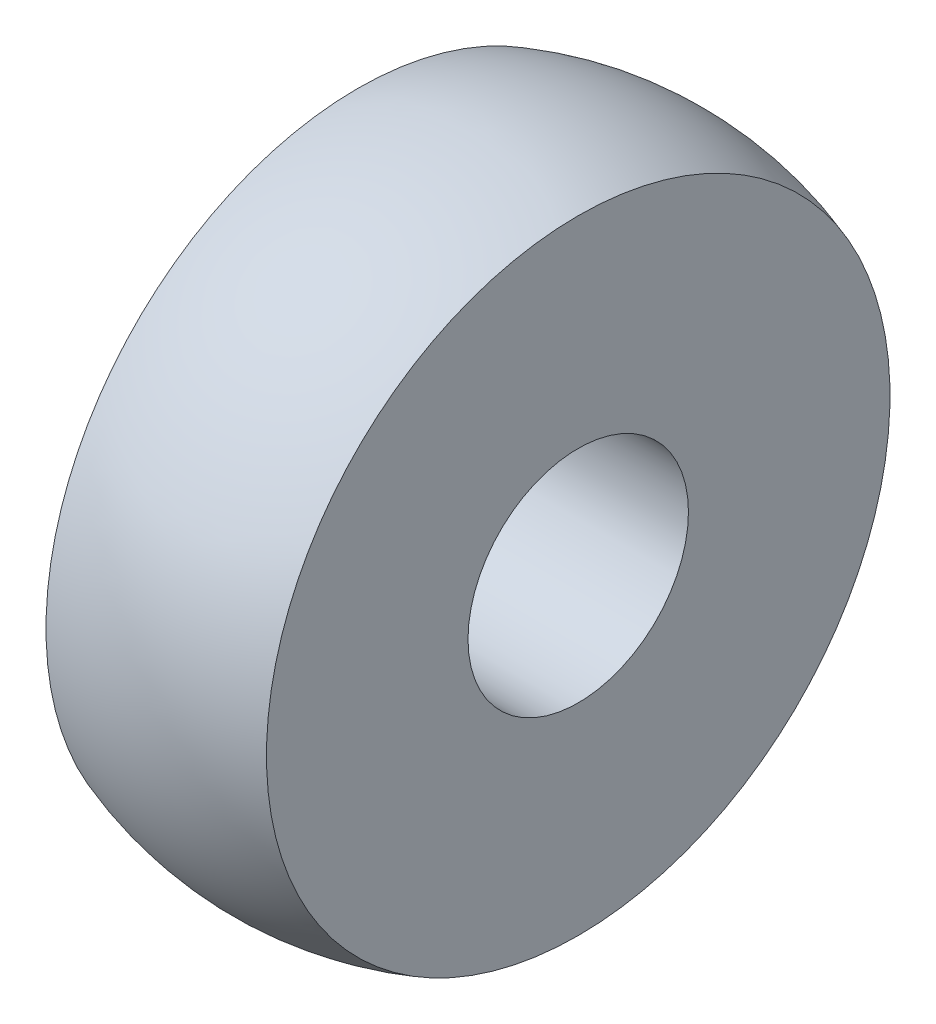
ISO-10303-21;
HEADER;
FILE_DESCRIPTION(('STEP AP214'),'2;1');
FILE_NAME('part.step','',(''),(''),'','','');
FILE_SCHEMA(('AUTOMOTIVE_DESIGN { 1 0 10303 214 1 1 1 1 }'));
ENDSEC;
DATA;
#1=APPLICATION_CONTEXT('core data for automotive mechanical design processes');
#2=APPLICATION_PROTOCOL_DEFINITION('international standard','automotive_design',2000,#1);
#3=PRODUCT_CONTEXT('',#1,'mechanical');
#4=PRODUCT('Part','Part','',(#3));
#5=PRODUCT_RELATED_PRODUCT_CATEGORY('part','',(#4));
#6=PRODUCT_DEFINITION_FORMATION('','',#4);
#7=PRODUCT_DEFINITION_CONTEXT('part definition',#1,'design');
#8=PRODUCT_DEFINITION('design','',#6,#7);
#9=PRODUCT_DEFINITION_SHAPE('','',#8);
#10=(LENGTH_UNIT() NAMED_UNIT(*) SI_UNIT(.MILLI.,.METRE.));
#11=(NAMED_UNIT(*) PLANE_ANGLE_UNIT() SI_UNIT($,.RADIAN.));
#12=(NAMED_UNIT(*) SI_UNIT($,.STERADIAN.) SOLID_ANGLE_UNIT());
#13=UNCERTAINTY_MEASURE_WITH_UNIT(LENGTH_MEASURE(1.E-05),#10,'distance_accuracy_value','');
#14=(GEOMETRIC_REPRESENTATION_CONTEXT(3) GLOBAL_UNCERTAINTY_ASSIGNED_CONTEXT((#13)) GLOBAL_UNIT_ASSIGNED_CONTEXT((#10,
#11,#12)) REPRESENTATION_CONTEXT('',''));
#15=CARTESIAN_POINT('',(0.,0.,0.));
#16=DIRECTION('',(0.,0.,1.));
#17=DIRECTION('',(1.,0.,0.));
#18=AXIS2_PLACEMENT_3D('',#15,#16,#17);
#19=CARTESIAN_POINT('',(-6.35,6.35,0.));
#20=DIRECTION('',(1.,0.,0.));
#21=DIRECTION('',(0.,0.,-1.));
#22=AXIS2_PLACEMENT_3D('',#19,#20,#21);
#23=PLANE('',#22);
#24=CARTESIAN_POINT('',(-6.35,0.,0.));
#25=DIRECTION('',(-1.,0.,0.));
#26=DIRECTION('',(0.,0.,1.));
#27=AXIS2_PLACEMENT_3D('',#24,#25,#26);
#28=CIRCLE('',#27,6.35);
#29=CARTESIAN_POINT('',(-6.35,0.,6.35));
#30=VERTEX_POINT('',#29);
#31=EDGE_CURVE('E40',#30,#30,#28,.T.);
#32=ORIENTED_EDGE('',*,*,#31,.F.);
#33=EDGE_LOOP('',(#32));
#34=FACE_BOUND('',#33,.T.);
#35=CARTESIAN_POINT('',(-6.35,0.,0.));
#36=DIRECTION('',(-1.,0.,0.));
#37=DIRECTION('',(0.,0.,1.));
#38=AXIS2_PLACEMENT_3D('',#35,#36,#37);
#39=CIRCLE('',#38,17.9605122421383);
#40=CARTESIAN_POINT('',(-6.35,17.9605122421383,0.));
#41=VERTEX_POINT('',#40);
#42=EDGE_CURVE('E10',#41,#41,#39,.T.);
#43=ORIENTED_EDGE('',*,*,#42,.T.);
#44=EDGE_LOOP('',(#43));
#45=FACE_BOUND('',#44,.T.);
#46=ADVANCED_FACE('F26',(#34,#45),#23,.F.);
#47=CARTESIAN_POINT('',(0.,0.,0.));
#48=DIRECTION('',(-1.,0.,0.));
#49=DIRECTION('',(0.,1.,0.));
#50=AXIS2_PLACEMENT_3D('',#47,#48,#49);
#51=SPHERICAL_SURFACE('',#50,19.05);
#52=CARTESIAN_POINT('',(6.35,0.,0.));
#53=DIRECTION('',(-1.,0.,0.));
#54=DIRECTION('',(0.,0.,1.));
#55=AXIS2_PLACEMENT_3D('',#52,#53,#54);
#56=CIRCLE('',#55,17.9605122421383);
#57=CARTESIAN_POINT('',(6.35,17.9605122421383,0.));
#58=VERTEX_POINT('',#57);
#59=EDGE_CURVE('E32',#58,#58,#56,.T.);
#60=CARTESIAN_POINT('',(-6.35,17.9605122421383,0.));
#61=CARTESIAN_POINT('',(-6.22284080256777,18.0054700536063,0.));
#62=CARTESIAN_POINT('',(-6.09520401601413,18.0490770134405,0.));
#63=CARTESIAN_POINT('',(-5.83903316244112,18.133570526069,0.));
#64=CARTESIAN_POINT('',(-5.71049909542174,18.1744570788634,0.));
#65=CARTESIAN_POINT('',(-5.45259157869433,18.2534910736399,0.));
#66=CARTESIAN_POINT('',(-5.32321812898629,18.291638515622,0.));
#67=CARTESIAN_POINT('',(-5.06369023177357,18.3651771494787,0.));
#68=CARTESIAN_POINT('',(-4.93353578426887,18.4005683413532,0.));
#69=CARTESIAN_POINT('',(-4.67250459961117,18.468578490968,0.));
#70=CARTESIAN_POINT('',(-4.54162786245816,18.5011974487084,0.));
#71=CARTESIAN_POINT('',(-4.279211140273,18.5636484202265,0.));
#72=CARTESIAN_POINT('',(-4.14767115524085,18.5934804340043,0.));
#73=CARTESIAN_POINT('',(-3.88398727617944,18.6503440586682,0.));
#74=CARTESIAN_POINT('',(-3.75184338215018,18.6773756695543,0.));
#75=CARTESIAN_POINT('',(-3.4870112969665,18.7286262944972,0.));
#76=CARTESIAN_POINT('',(-3.35432310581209,18.752845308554,0.));
#77=CARTESIAN_POINT('',(-3.08846228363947,18.7984598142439,0.));
#78=CARTESIAN_POINT('',(-2.95528965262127,18.819855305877,0.));
#79=CARTESIAN_POINT('',(-2.68852002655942,18.8598131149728,0.));
#80=CARTESIAN_POINT('',(-2.55492303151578,18.8783754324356,0.));
#81=CARTESIAN_POINT('',(-2.28736494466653,18.9126585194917,0.));
#82=CARTESIAN_POINT('',(-2.15340385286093,18.928379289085,0.));
#83=CARTESIAN_POINT('',(-1.8851780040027,18.9569721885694,0.));
#84=CARTESIAN_POINT('',(-1.75091324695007,18.9698443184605,0.));
#85=CARTESIAN_POINT('',(-1.48214063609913,18.992734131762,0.));
#86=CARTESIAN_POINT('',(-1.34763278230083,19.0027518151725,0.));
#87=CARTESIAN_POINT('',(-1.07843465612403,19.0199282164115,0.));
#88=CARTESIAN_POINT('',(-0.943744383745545,19.0270869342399,0.));
#89=CARTESIAN_POINT('',(-0.674242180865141,19.0385421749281,0.));
#90=CARTESIAN_POINT('',(-0.539430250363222,19.0428386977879,0.));
#91=CARTESIAN_POINT('',(-0.269745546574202,19.0485676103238,0.));
#92=CARTESIAN_POINT('',(-0.1348727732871,19.05,0.));
#93=CARTESIAN_POINT('',(0.134872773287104,19.05,0.));
#94=CARTESIAN_POINT('',(0.269745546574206,19.0485676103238,0.));
#95=CARTESIAN_POINT('',(0.539430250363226,19.0428386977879,0.));
#96=CARTESIAN_POINT('',(0.674242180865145,19.0385421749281,0.));
#97=CARTESIAN_POINT('',(0.943744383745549,19.0270869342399,0.));
#98=CARTESIAN_POINT('',(1.07843465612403,19.0199282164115,0.));
#99=CARTESIAN_POINT('',(1.34763278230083,19.0027518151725,0.));
#100=CARTESIAN_POINT('',(1.48214063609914,18.992734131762,0.));
#101=CARTESIAN_POINT('',(1.75091324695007,18.9698443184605,0.));
#102=CARTESIAN_POINT('',(1.8851780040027,18.9569721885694,0.));
#103=CARTESIAN_POINT('',(2.15340385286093,18.928379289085,0.));
#104=CARTESIAN_POINT('',(2.28736494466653,18.9126585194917,0.));
#105=CARTESIAN_POINT('',(2.55492303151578,18.8783754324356,0.));
#106=CARTESIAN_POINT('',(2.68852002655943,18.8598131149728,0.));
#107=CARTESIAN_POINT('',(2.95528965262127,18.819855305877,0.));
#108=CARTESIAN_POINT('',(3.08846228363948,18.7984598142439,0.));
#109=CARTESIAN_POINT('',(3.35432310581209,18.752845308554,0.));
#110=CARTESIAN_POINT('',(3.4870112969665,18.7286262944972,0.));
#111=CARTESIAN_POINT('',(3.75184338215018,18.6773756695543,0.));
#112=CARTESIAN_POINT('',(3.88398727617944,18.6503440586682,0.));
#113=CARTESIAN_POINT('',(4.14767115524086,18.5934804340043,0.));
#114=CARTESIAN_POINT('',(4.27921114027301,18.5636484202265,0.));
#115=CARTESIAN_POINT('',(4.54162786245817,18.5011974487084,0.));
#116=CARTESIAN_POINT('',(4.67250459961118,18.468578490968,0.));
#117=CARTESIAN_POINT('',(4.93353578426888,18.4005683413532,0.));
#118=CARTESIAN_POINT('',(5.06369023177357,18.3651771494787,0.));
#119=CARTESIAN_POINT('',(5.3232181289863,18.291638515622,0.));
#120=CARTESIAN_POINT('',(5.45259157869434,18.2534910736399,0.));
#121=CARTESIAN_POINT('',(5.71049909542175,18.1744570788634,0.));
#122=CARTESIAN_POINT('',(5.83903316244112,18.133570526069,0.));
#123=CARTESIAN_POINT('',(6.09520401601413,18.0490770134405,0.));
#124=CARTESIAN_POINT('',(6.22284080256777,18.0054700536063,0.));
#125=CARTESIAN_POINT('',(6.35,17.9605122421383,0.));
#126=B_SPLINE_CURVE_WITH_KNOTS('',3,(#60,#61,#62,#63,#64,#65,#66,#67,#68,#69,#70,#71,#72,#73,
#74,#75,#76,#77,#78,#79,#80,#81,#82,#83,#84,#85,#86,#87,#88,#89,#90,#91,#92,#93,#94,#95,#96,#97,
#98,#99,#100,#101,#102,#103,#104,#105,#106,#107,#108,#109,#110,#111,#112,#113,#114,#115,#116,
#117,#118,#119,#120,#121,#122,#123,#124,#125),.UNSPECIFIED.,.F.,.F.,(4,2,2,2,2,2,2,2,2,2,2,2,2,
2,2,2,2,2,2,2,2,2,2,2,2,2,2,2,2,2,2,2,4),(0.,0.404610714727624,0.809221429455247,
1.21383214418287,1.61844285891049,2.02305357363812,2.42766428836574,2.83227500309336,
3.23688571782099,3.64149643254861,4.04610714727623,4.45071786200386,4.85532857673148,
5.25993929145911,5.66455000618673,6.06916072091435,6.47377143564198,6.8783821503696,
7.28299286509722,7.68760357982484,8.09221429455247,8.49682500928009,8.90143572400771,
9.30604643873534,9.71065715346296,10.1152678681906,10.5198785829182,10.9244892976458,
11.3291000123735,11.7337107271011,12.1383214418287,12.5429321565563,12.947542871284),.UNSPECIFIED.);
#127=EDGE_CURVE('BSEAM49',#41,#58,#126,.T.);
#128=ORIENTED_EDGE('',*,*,#42,.F.);
#129=ORIENTED_EDGE('',*,*,#59,.T.);
#130=ORIENTED_EDGE('',*,*,#127,.T.);
#131=ORIENTED_EDGE('',*,*,#127,.F.);
#132=EDGE_LOOP('',(#128,#130,#129,#131));
#133=FACE_BOUND('',#132,.T.);
#134=ADVANCED_FACE('F49',(#133),#51,.T.);
#135=CARTESIAN_POINT('',(6.35,6.35,0.));
#136=DIRECTION('',(-1.,0.,0.));
#137=DIRECTION('',(0.,0.,1.));
#138=AXIS2_PLACEMENT_3D('',#135,#136,#137);
#139=PLANE('',#138);
#140=ORIENTED_EDGE('',*,*,#59,.F.);
#141=EDGE_LOOP('',(#140));
#142=FACE_BOUND('',#141,.T.);
#143=CARTESIAN_POINT('',(6.35,0.,0.));
#144=DIRECTION('',(-1.,0.,0.));
#145=DIRECTION('',(0.,0.,1.));
#146=AXIS2_PLACEMENT_3D('',#143,#144,#145);
#147=CIRCLE('',#146,6.35);
#148=CARTESIAN_POINT('',(6.35,0.,6.35));
#149=VERTEX_POINT('',#148);
#150=EDGE_CURVE('E36',#149,#149,#147,.T.);
#151=ORIENTED_EDGE('',*,*,#150,.T.);
#152=EDGE_LOOP('',(#151));
#153=FACE_BOUND('',#152,.T.);
#154=ADVANCED_FACE('F53',(#142,#153),#139,.F.);
#155=CARTESIAN_POINT('',(-11.4720383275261,0.,0.));
#156=DIRECTION('',(-1.,0.,0.));
#157=DIRECTION('',(0.,0.,1.));
#158=AXIS2_PLACEMENT_3D('',#155,#156,#157);
#159=CYLINDRICAL_SURFACE('',#158,6.35);
#160=ORIENTED_EDGE('',*,*,#150,.F.);
#161=EDGE_LOOP('',(#160));
#162=FACE_BOUND('',#161,.T.);
#163=ORIENTED_EDGE('',*,*,#31,.T.);
#164=EDGE_LOOP('',(#163));
#165=FACE_BOUND('',#164,.T.);
#166=ADVANCED_FACE('F46',(#162,#165),#159,.F.);
#167=CLOSED_SHELL('',(#46,#134,#154,#166));
#168=MANIFOLD_SOLID_BREP('B2',#167);
#169=ADVANCED_BREP_SHAPE_REPRESENTATION('',(#18,#168),#14);
#170=SHAPE_DEFINITION_REPRESENTATION(#9,#169);
ENDSEC;
END-ISO-10303-21;
